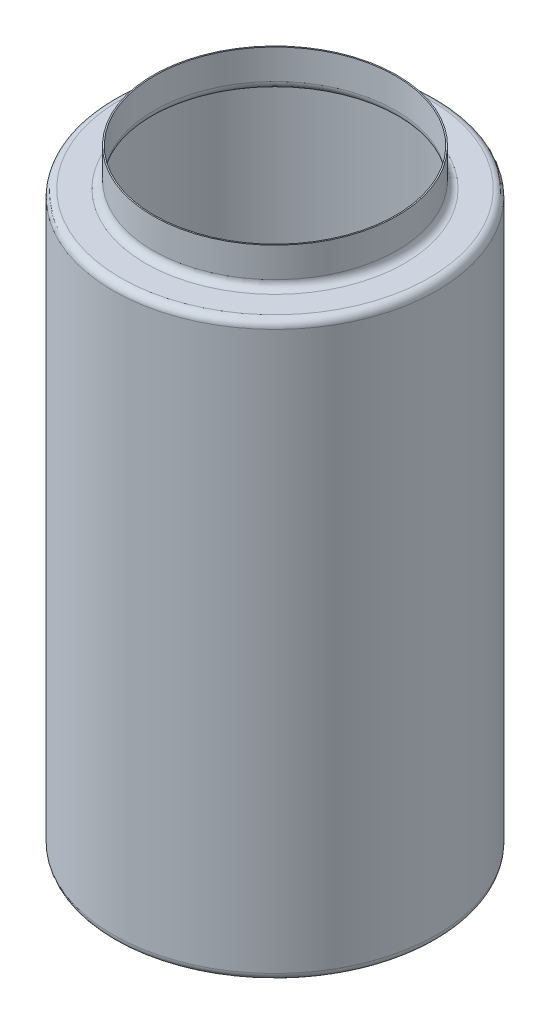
ISO-10303-21;
HEADER;
FILE_DESCRIPTION(('STEP AP214'),'2;1');
FILE_NAME('part.step','',(''),(''),'','','');
FILE_SCHEMA(('AUTOMOTIVE_DESIGN { 1 0 10303 214 1 1 1 1 }'));
ENDSEC;
DATA;
#1=APPLICATION_CONTEXT('core data for automotive mechanical design processes');
#2=APPLICATION_PROTOCOL_DEFINITION('international standard','automotive_design',2000,#1);
#3=PRODUCT_CONTEXT('',#1,'mechanical');
#4=PRODUCT('Part','Part','',(#3));
#5=PRODUCT_RELATED_PRODUCT_CATEGORY('part','',(#4));
#6=PRODUCT_DEFINITION_FORMATION('','',#4);
#7=PRODUCT_DEFINITION_CONTEXT('part definition',#1,'design');
#8=PRODUCT_DEFINITION('design','',#6,#7);
#9=PRODUCT_DEFINITION_SHAPE('','',#8);
#10=(LENGTH_UNIT() NAMED_UNIT(*) SI_UNIT(.MILLI.,.METRE.));
#11=(NAMED_UNIT(*) PLANE_ANGLE_UNIT() SI_UNIT($,.RADIAN.));
#12=(NAMED_UNIT(*) SI_UNIT($,.STERADIAN.) SOLID_ANGLE_UNIT());
#13=UNCERTAINTY_MEASURE_WITH_UNIT(LENGTH_MEASURE(1.E-05),#10,'distance_accuracy_value','');
#14=(GEOMETRIC_REPRESENTATION_CONTEXT(3) GLOBAL_UNCERTAINTY_ASSIGNED_CONTEXT((#13)) GLOBAL_UNIT_ASSIGNED_CONTEXT((#10,
#11,#12)) REPRESENTATION_CONTEXT('',''));
#15=CARTESIAN_POINT('',(0.,0.,0.));
#16=DIRECTION('',(0.,0.,1.));
#17=DIRECTION('',(1.,0.,0.));
#18=AXIS2_PLACEMENT_3D('',#15,#16,#17);
#19=CARTESIAN_POINT('',(0.,230.,0.));
#20=DIRECTION('',(0.,1.,0.));
#21=DIRECTION('',(0.,0.,1.));
#22=AXIS2_PLACEMENT_3D('',#19,#20,#21);
#23=PLANE('',#22);
#24=CARTESIAN_POINT('',(0.,230.,0.));
#25=DIRECTION('',(0.,1.,0.));
#26=DIRECTION('',(0.,0.,1.));
#27=AXIS2_PLACEMENT_3D('',#24,#25,#26);
#28=CIRCLE('',#27,52.);
#29=CARTESIAN_POINT('',(0.,230.,52.));
#30=VERTEX_POINT('',#29);
#31=EDGE_CURVE('E10',#30,#30,#28,.F.);
#32=ORIENTED_EDGE('',*,*,#31,.T.);
#33=EDGE_LOOP('',(#32));
#34=FACE_BOUND('',#33,.T.);
#35=CARTESIAN_POINT('',(0.,230.,0.));
#36=DIRECTION('',(0.,1.,0.));
#37=DIRECTION('',(0.,0.,1.));
#38=AXIS2_PLACEMENT_3D('',#35,#36,#37);
#39=CIRCLE('',#38,62.);
#40=CARTESIAN_POINT('',(0.,230.,62.));
#41=VERTEX_POINT('',#40);
#42=EDGE_CURVE('E35',#41,#41,#39,.T.);
#43=ORIENTED_EDGE('',*,*,#42,.T.);
#44=EDGE_LOOP('',(#43));
#45=FACE_BOUND('',#44,.T.);
#46=ADVANCED_FACE('F28',(#34,#45),#23,.T.);
#47=CARTESIAN_POINT('',(0.,230.,0.));
#48=DIRECTION('',(0.,-1.,0.));
#49=DIRECTION('',(0.,0.,-1.));
#50=AXIS2_PLACEMENT_3D('',#47,#48,#49);
#51=CYLINDRICAL_SURFACE('',#50,65.);
#52=CARTESIAN_POINT('',(0.,3.,0.));
#53=DIRECTION('',(0.,1.,0.));
#54=DIRECTION('',(0.,0.,1.));
#55=AXIS2_PLACEMENT_3D('',#52,#53,#54);
#56=CIRCLE('',#55,65.);
#57=CARTESIAN_POINT('',(0.,3.,65.));
#58=VERTEX_POINT('',#57);
#59=EDGE_CURVE('E48',#58,#58,#56,.T.);
#60=ORIENTED_EDGE('',*,*,#59,.T.);
#61=EDGE_LOOP('',(#60));
#62=FACE_BOUND('',#61,.T.);
#63=CARTESIAN_POINT('',(0.,227.,0.));
#64=DIRECTION('',(0.,1.,0.));
#65=DIRECTION('',(0.,0.,1.));
#66=AXIS2_PLACEMENT_3D('',#63,#64,#65);
#67=CIRCLE('',#66,65.);
#68=CARTESIAN_POINT('',(0.,227.,65.));
#69=VERTEX_POINT('',#68);
#70=EDGE_CURVE('E51',#69,#69,#67,.F.);
#71=ORIENTED_EDGE('',*,*,#70,.T.);
#72=EDGE_LOOP('',(#71));
#73=FACE_BOUND('',#72,.T.);
#74=ADVANCED_FACE('F100',(#62,#73),#51,.T.);
#75=CARTESIAN_POINT('',(0.,0.,0.));
#76=DIRECTION('',(0.,1.,0.));
#77=DIRECTION('',(0.,0.,1.));
#78=AXIS2_PLACEMENT_3D('',#75,#76,#77);
#79=PLANE('',#78);
#80=CARTESIAN_POINT('',(0.,0.,0.));
#81=DIRECTION('',(0.,1.,0.));
#82=DIRECTION('',(0.,0.,1.));
#83=AXIS2_PLACEMENT_3D('',#80,#81,#82);
#84=CIRCLE('',#83,62.);
#85=CARTESIAN_POINT('',(0.,0.,62.));
#86=VERTEX_POINT('',#85);
#87=EDGE_CURVE('E43',#86,#86,#84,.F.);
#88=ORIENTED_EDGE('',*,*,#87,.T.);
#89=EDGE_LOOP('',(#88));
#90=FACE_BOUND('',#89,.T.);
#91=ADVANCED_FACE('F105',(#90),#79,.F.);
#92=CARTESIAN_POINT('',(0.,245.,0.));
#93=DIRECTION('',(0.,-1.,0.));
#94=DIRECTION('',(0.,0.,-1.));
#95=AXIS2_PLACEMENT_3D('',#92,#93,#94);
#96=CYLINDRICAL_SURFACE('',#95,49.);
#97=CARTESIAN_POINT('',(0.,233.,0.));
#98=DIRECTION('',(0.,1.,0.));
#99=DIRECTION('',(0.,0.,1.));
#100=AXIS2_PLACEMENT_3D('',#97,#98,#99);
#101=CIRCLE('',#100,49.);
#102=CARTESIAN_POINT('',(0.,233.,49.));
#103=VERTEX_POINT('',#102);
#104=EDGE_CURVE('E39',#103,#103,#101,.T.);
#105=ORIENTED_EDGE('',*,*,#104,.T.);
#106=EDGE_LOOP('',(#105));
#107=FACE_BOUND('',#106,.T.);
#108=CARTESIAN_POINT('',(0.,245.,0.));
#109=DIRECTION('',(0.,1.,0.));
#110=DIRECTION('',(0.,0.,1.));
#111=AXIS2_PLACEMENT_3D('',#108,#109,#110);
#112=CIRCLE('',#111,49.);
#113=CARTESIAN_POINT('',(0.,245.,49.));
#114=VERTEX_POINT('',#113);
#115=EDGE_CURVE('E54',#114,#114,#112,.T.);
#116=ORIENTED_EDGE('',*,*,#115,.F.);
#117=EDGE_LOOP('',(#116));
#118=FACE_BOUND('',#117,.T.);
#119=ADVANCED_FACE('F110',(#107,#118),#96,.T.);
#120=CARTESIAN_POINT('',(0.,245.,0.));
#121=DIRECTION('',(0.,1.,0.));
#122=DIRECTION('',(0.,0.,1.));
#123=AXIS2_PLACEMENT_3D('',#120,#121,#122);
#124=PLANE('',#123);
#125=CARTESIAN_POINT('',(0.,245.,0.));
#126=DIRECTION('',(0.,1.,0.));
#127=DIRECTION('',(0.,0.,1.));
#128=AXIS2_PLACEMENT_3D('',#125,#126,#127);
#129=CIRCLE('',#128,48.5);
#130=CARTESIAN_POINT('',(0.,245.,48.5));
#131=VERTEX_POINT('',#130);
#132=EDGE_CURVE('E58',#131,#131,#129,.T.);
#133=ORIENTED_EDGE('',*,*,#132,.F.);
#134=EDGE_LOOP('',(#133));
#135=FACE_BOUND('',#134,.T.);
#136=ORIENTED_EDGE('',*,*,#115,.T.);
#137=EDGE_LOOP('',(#136));
#138=FACE_BOUND('',#137,.T.);
#139=ADVANCED_FACE('F117',(#135,#138),#124,.T.);
#140=CARTESIAN_POINT('',(0.,3.,0.));
#141=DIRECTION('',(0.,1.,0.));
#142=DIRECTION('',(0.,0.,1.));
#143=AXIS2_PLACEMENT_3D('',#140,#141,#142);
#144=TOROIDAL_SURFACE('',#143,62.,3.);
#145=ORIENTED_EDGE('',*,*,#87,.F.);
#146=EDGE_LOOP('',(#145));
#147=FACE_BOUND('',#146,.T.);
#148=ORIENTED_EDGE('',*,*,#59,.F.);
#149=EDGE_LOOP('',(#148));
#150=FACE_BOUND('',#149,.T.);
#151=ADVANCED_FACE('F114',(#147,#150),#144,.T.);
#152=CARTESIAN_POINT('',(0.,233.,0.));
#153=DIRECTION('',(0.,1.,0.));
#154=DIRECTION('',(0.,0.,1.));
#155=AXIS2_PLACEMENT_3D('',#152,#153,#154);
#156=TOROIDAL_SURFACE('',#155,52.,3.);
#157=ORIENTED_EDGE('',*,*,#31,.F.);
#158=EDGE_LOOP('',(#157));
#159=FACE_BOUND('',#158,.T.);
#160=ORIENTED_EDGE('',*,*,#104,.F.);
#161=EDGE_LOOP('',(#160));
#162=FACE_BOUND('',#161,.T.);
#163=ADVANCED_FACE('F116',(#159,#162),#156,.F.);
#164=CARTESIAN_POINT('',(0.,227.,0.));
#165=DIRECTION('',(0.,1.,0.));
#166=DIRECTION('',(0.,0.,1.));
#167=AXIS2_PLACEMENT_3D('',#164,#165,#166);
#168=TOROIDAL_SURFACE('',#167,62.,3.);
#169=ORIENTED_EDGE('',*,*,#70,.F.);
#170=EDGE_LOOP('',(#169));
#171=FACE_BOUND('',#170,.T.);
#172=ORIENTED_EDGE('',*,*,#42,.F.);
#173=EDGE_LOOP('',(#172));
#174=FACE_BOUND('',#173,.T.);
#175=ADVANCED_FACE('F30',(#171,#174),#168,.T.);
#176=CARTESIAN_POINT('',(0.,229.5,0.));
#177=DIRECTION('',(0.,1.,0.));
#178=DIRECTION('',(0.,0.,1.));
#179=AXIS2_PLACEMENT_3D('',#176,#177,#178);
#180=PLANE('',#179);
#181=CARTESIAN_POINT('',(0.,229.5,0.));
#182=DIRECTION('',(0.,1.,0.));
#183=DIRECTION('',(0.,0.,1.));
#184=AXIS2_PLACEMENT_3D('',#181,#182,#183);
#185=CIRCLE('',#184,52.);
#186=CARTESIAN_POINT('',(0.,229.5,52.));
#187=VERTEX_POINT('',#186);
#188=EDGE_CURVE('E57',#187,#187,#185,.F.);
#189=ORIENTED_EDGE('',*,*,#188,.F.);
#190=EDGE_LOOP('',(#189));
#191=FACE_BOUND('',#190,.T.);
#192=CARTESIAN_POINT('',(0.,229.5,0.));
#193=DIRECTION('',(0.,1.,0.));
#194=DIRECTION('',(0.,0.,1.));
#195=AXIS2_PLACEMENT_3D('',#192,#193,#194);
#196=CIRCLE('',#195,62.);
#197=CARTESIAN_POINT('',(0.,229.5,62.));
#198=VERTEX_POINT('',#197);
#199=EDGE_CURVE('E73',#198,#198,#196,.T.);
#200=ORIENTED_EDGE('',*,*,#199,.F.);
#201=EDGE_LOOP('',(#200));
#202=FACE_BOUND('',#201,.T.);
#203=ADVANCED_FACE('F82',(#191,#202),#180,.F.);
#204=CARTESIAN_POINT('',(0.,230.,0.));
#205=DIRECTION('',(0.,-1.,0.));
#206=DIRECTION('',(0.,0.,-1.));
#207=AXIS2_PLACEMENT_3D('',#204,#205,#206);
#208=CYLINDRICAL_SURFACE('',#207,64.5);
#209=CARTESIAN_POINT('',(0.,3.,0.));
#210=DIRECTION('',(0.,-1.,0.));
#211=DIRECTION('',(0.,0.,-1.));
#212=AXIS2_PLACEMENT_3D('',#209,#210,#211);
#213=CIRCLE('',#212,64.5);
#214=CARTESIAN_POINT('',(0.,3.,-64.5));
#215=VERTEX_POINT('',#214);
#216=EDGE_CURVE('E66',#215,#215,#213,.F.);
#217=ORIENTED_EDGE('',*,*,#216,.F.);
#218=EDGE_LOOP('',(#217));
#219=FACE_BOUND('',#218,.T.);
#220=CARTESIAN_POINT('',(0.,227.,0.));
#221=DIRECTION('',(0.,-1.,0.));
#222=DIRECTION('',(0.,0.,-1.));
#223=AXIS2_PLACEMENT_3D('',#220,#221,#222);
#224=CIRCLE('',#223,64.5);
#225=CARTESIAN_POINT('',(0.,227.,-64.5));
#226=VERTEX_POINT('',#225);
#227=EDGE_CURVE('E61',#226,#226,#224,.T.);
#228=ORIENTED_EDGE('',*,*,#227,.F.);
#229=EDGE_LOOP('',(#228));
#230=FACE_BOUND('',#229,.T.);
#231=ADVANCED_FACE('F85',(#219,#230),#208,.F.);
#232=CARTESIAN_POINT('',(0.,0.5,0.));
#233=DIRECTION('',(0.,1.,0.));
#234=DIRECTION('',(0.,0.,1.));
#235=AXIS2_PLACEMENT_3D('',#232,#233,#234);
#236=PLANE('',#235);
#237=CARTESIAN_POINT('',(0.,0.500000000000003,0.));
#238=DIRECTION('',(0.,1.,0.));
#239=DIRECTION('',(0.,0.,1.));
#240=AXIS2_PLACEMENT_3D('',#237,#238,#239);
#241=CIRCLE('',#240,62.);
#242=CARTESIAN_POINT('',(0.,0.500000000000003,62.));
#243=VERTEX_POINT('',#242);
#244=EDGE_CURVE('E62',#243,#243,#241,.F.);
#245=ORIENTED_EDGE('',*,*,#244,.F.);
#246=EDGE_LOOP('',(#245));
#247=FACE_BOUND('',#246,.T.);
#248=ADVANCED_FACE('F140',(#247),#236,.T.);
#249=CARTESIAN_POINT('',(0.,245.,0.));
#250=DIRECTION('',(0.,-1.,0.));
#251=DIRECTION('',(0.,0.,-1.));
#252=AXIS2_PLACEMENT_3D('',#249,#250,#251);
#253=CYLINDRICAL_SURFACE('',#252,48.5);
#254=CARTESIAN_POINT('',(0.,233.,0.));
#255=DIRECTION('',(0.,-1.,0.));
#256=DIRECTION('',(0.,0.,-1.));
#257=AXIS2_PLACEMENT_3D('',#254,#255,#256);
#258=CIRCLE('',#257,48.5);
#259=CARTESIAN_POINT('',(0.,233.,-48.5));
#260=VERTEX_POINT('',#259);
#261=EDGE_CURVE('E65',#260,#260,#258,.F.);
#262=ORIENTED_EDGE('',*,*,#261,.F.);
#263=EDGE_LOOP('',(#262));
#264=FACE_BOUND('',#263,.T.);
#265=ORIENTED_EDGE('',*,*,#132,.T.);
#266=EDGE_LOOP('',(#265));
#267=FACE_BOUND('',#266,.T.);
#268=ADVANCED_FACE('F138',(#264,#267),#253,.F.);
#269=CARTESIAN_POINT('',(0.,3.,0.));
#270=DIRECTION('',(0.,1.,0.));
#271=DIRECTION('',(0.,0.,1.));
#272=AXIS2_PLACEMENT_3D('',#269,#270,#271);
#273=TOROIDAL_SURFACE('',#272,62.,2.5);
#274=ORIENTED_EDGE('',*,*,#244,.T.);
#275=EDGE_LOOP('',(#274));
#276=FACE_BOUND('',#275,.T.);
#277=ORIENTED_EDGE('',*,*,#216,.T.);
#278=EDGE_LOOP('',(#277));
#279=FACE_BOUND('',#278,.T.);
#280=ADVANCED_FACE('F96',(#276,#279),#273,.F.);
#281=CARTESIAN_POINT('',(0.,233.,0.));
#282=DIRECTION('',(0.,1.,0.));
#283=DIRECTION('',(0.,0.,1.));
#284=AXIS2_PLACEMENT_3D('',#281,#282,#283);
#285=TOROIDAL_SURFACE('',#284,52.,3.5);
#286=ORIENTED_EDGE('',*,*,#188,.T.);
#287=EDGE_LOOP('',(#286));
#288=FACE_BOUND('',#287,.T.);
#289=ORIENTED_EDGE('',*,*,#261,.T.);
#290=EDGE_LOOP('',(#289));
#291=FACE_BOUND('',#290,.T.);
#292=ADVANCED_FACE('F79',(#288,#291),#285,.T.);
#293=CARTESIAN_POINT('',(0.,227.,0.));
#294=DIRECTION('',(0.,1.,0.));
#295=DIRECTION('',(0.,0.,1.));
#296=AXIS2_PLACEMENT_3D('',#293,#294,#295);
#297=TOROIDAL_SURFACE('',#296,62.,2.5);
#298=ORIENTED_EDGE('',*,*,#227,.T.);
#299=EDGE_LOOP('',(#298));
#300=FACE_BOUND('',#299,.T.);
#301=ORIENTED_EDGE('',*,*,#199,.T.);
#302=EDGE_LOOP('',(#301));
#303=FACE_BOUND('',#302,.T.);
#304=ADVANCED_FACE('F89',(#300,#303),#297,.F.);
#305=CLOSED_SHELL('',(#46,#74,#91,#119,#139,#151,#163,#175,#203,#231,#248,#268,#280,#292,#304));
#306=MANIFOLD_SOLID_BREP('B2',#305);
#307=ADVANCED_BREP_SHAPE_REPRESENTATION('',(#18,#306),#14);
#308=SHAPE_DEFINITION_REPRESENTATION(#9,#307);
ENDSEC;
END-ISO-10303-21;
